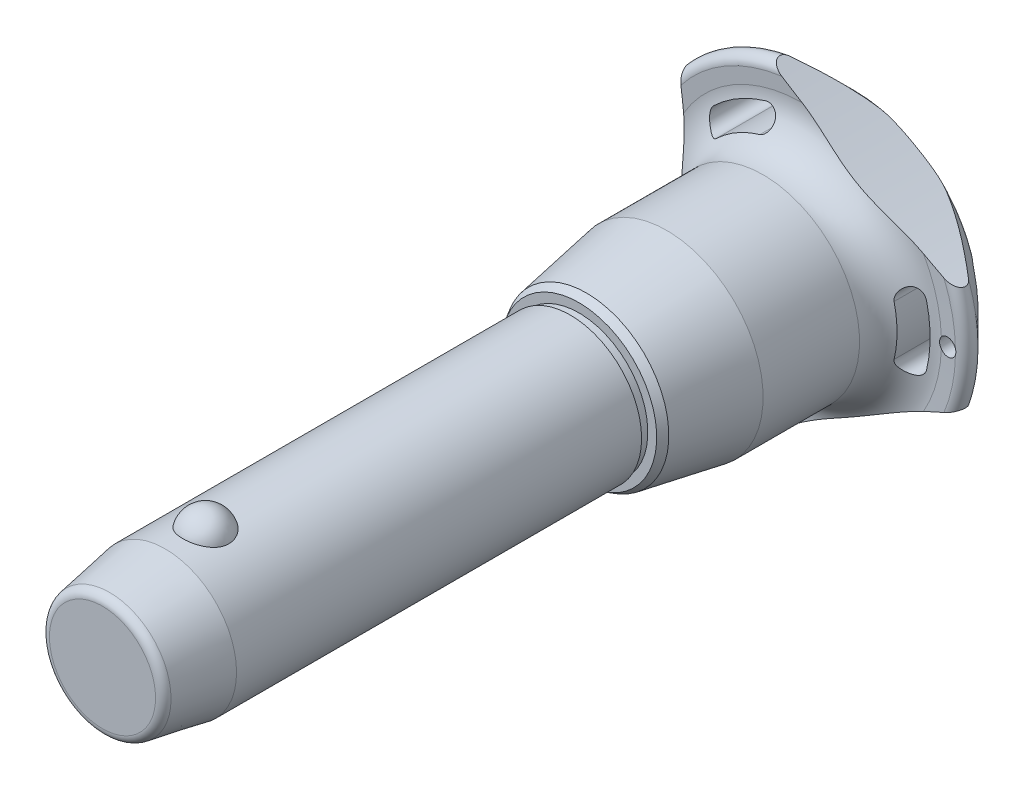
from build123d import *

# Parameters (mm, degrees)
SKETCH1_R           = 12.5
BOSS_EXTRUDE1_DEPTH = 60
SKETCH2_R           = 10
BOSS_EXTRUDE2_DEPTH = 50.7
BOSS_EXTRUDE3_START = 22
SKETCH1_2_R         = 12.5
BOSS_EXTRUDE3_DEPTH = 22
CHAMFER1_SIZE       = 11
CHAMFER1_SIZE2      = 1.939596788
FILLET1_R           = 1.5
SKETCH6_R           = 176.92625
CUT_EXTRUDE1_DEPTH  = 118.833791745
CIRPATTERN1_COUNT   = 3
SKETCH7_R           = 1.5
CUT_EXTRUDE2_DEPTH  = 118.704532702


with BuildPart() as part:
    # Sketch1 → Boss-Extrude1 (new body)
    with BuildSketch(Plane.XY):
        Circle(SKETCH1_R)
    extrude(amount=-BOSS_EXTRUDE1_DEPTH)

    # Sketch2 → Boss-Extrude2 (add)
    with BuildSketch(Plane(origin=(0, 0, -60), x_dir=(-1, 0, 0), z_dir=(0, 0, -1))):
        with Locations(Location((0, 0, 0), (0, 0, 180))):
            Circle(SKETCH2_R)
    extrude(amount=BOSS_EXTRUDE2_DEPTH)

    # Sketch3 → Revolve1 (revolve)
    with BuildSketch(Plane(origin=(0, 0, 0), x_dir=(0, 0, -1), z_dir=(1, 0, 0))):
        with BuildLine():
            Line((-3.957271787, 15.4), (-3.957271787, 7.1))
            ThreePointArc((-3.957271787, 7.1), (0.192728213, 11.25), (-3.957271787, 15.4))
        make_face()
        with BuildLine():
            Line((-3.957271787, -7.1), (-3.957271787, -15.4))
            ThreePointArc((-3.957271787, -15.4), (0.192728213, -11.25), (-3.957271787, -7.1))
        make_face()
    revolve(axis=Axis((0, -7.1, 3.957271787), (0, 1, 0)))

    # Sketch1_2 → Boss-Extrude3 (add)
    with BuildSketch(Plane.XY.offset(BOSS_EXTRUDE3_START)):
        Circle(SKETCH1_2_R)
    extrude(amount=-BOSS_EXTRUDE3_DEPTH)

    # Chamfer1
    chamfer1_edges = [part.edges().sort_by_distance(p)[0] for p in [
        (-12.5, 0, 22),
    ]]
    chamfer1_side = [part.faces().sort_by_distance(p)[0] for p in [
        (-12.5, 0, -19),
    ]]
    chamfer(chamfer1_edges, length=CHAMFER1_SIZE, length2=CHAMFER1_SIZE2, reference=chamfer1_side[0])

    # Fillet1
    fillet1_edges = [part.edges().sort_by_distance(p)[0] for p in [
        (-10.560403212, 0, 22),
        (-10, 0, -110.7),
    ]]
    fillet(fillet1_edges, radius=FILLET1_R)

    # Sketch4 → Revolve2 (revolve)
    with BuildSketch(Plane(origin=(0, 0, 0), x_dir=(0, 0, -1), z_dir=(1, 0, 0)), mode=Mode.PRIVATE) as revolve2_sk:
        Polygon((60, 0), (60, 12.089202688), (61.5, 12.089202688), (61.5, 13.644437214), (62.846872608, 14.422054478), (76.9, 16.9), (93.8, 16.9), (93.8, 0), align=None)
    revolve(revolve2_sk.sketch.rotate(Axis((0, 0, -93.8), (0, 0, 1)), 90), axis=Axis((0, 0, -93.8), (0, 0, 1)))

    # Sketch5 → Revolve3 (revolve)
    with BuildSketch(Plane(origin=(0, 0, 0), x_dir=(0, 0, -1), z_dir=(1, 0, 0)), mode=Mode.PRIVATE) as revolve3_sk:
        with BuildLine():
            Line((100.790129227, 24.271609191), (100.652256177, 26.865060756))
            ThreePointArc((100.652256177, 26.865060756), (101.598671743, 28.411427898), (103.38137085, 28.08137085))
            Line((103.38137085, 28.08137085), (109.763226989, 21.69951471))
            ThreePointArc((109.763226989, 21.69951471), (110.7, 19.381044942), (109.683055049, 17.096604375))
            ThreePointArc((109.683055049, 17.096604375), (104.18864484, 9.321268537), (102.25, 0))
            Line((102.25, 0), (93.8, 0))
            Line((93.8, 0), (93.8, 16.9))
            ThreePointArc((93.8, 16.9), (98.879432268, 19.083427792), (100.790129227, 24.271609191))
        make_face()
    revolve(revolve3_sk.sketch.rotate(Axis((0, 0, -102.25), (0, 0, 1)), 90), axis=Axis((0, 0, -102.25), (0, 0, 1)))

    # Sketch6 → Cut-Extrude1 (cut, through all)
    with BuildSketch(Plane.XY):
        with Locations((-197.42625, 0)):
            Circle(SKETCH6_R)
        with BuildLine():
            ThreePointArc((21.802992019, -5.260839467), (22.428706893, 0), (21.802992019, 5.260839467))
            ThreePointArc((21.802992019, 5.260839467), (19.579234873, 6.620060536), (18.220013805, 4.39630339))
            ThreePointArc((18.220013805, 4.39630339), (18.742902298, 0), (18.220013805, -4.39630339))
            ThreePointArc((18.220013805, -4.39630339), (19.579234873, -6.620060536), (21.802992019, -5.260839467))
        make_face()
    cut_extrude1 = extrude(amount=-CUT_EXTRUDE1_DEPTH, mode=Mode.SUBTRACT)

    # CirPattern1: Cut-Extrude1 ×3 about axis
    cirpattern1_axis = Axis((0, 0, 0), (0, 0, 1))
    for i in range(1, CIRPATTERN1_COUNT):
        add(cut_extrude1.rotate(cirpattern1_axis, i * 360 / CIRPATTERN1_COUNT), mode=Mode.SUBTRACT)

    # Sketch7 → Cut-Extrude2 (cut, through all)
    with BuildSketch(Plane.XY):
        with Locations(Location((25.428706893, 0, 0), (0, 0, 17.230769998))):
            Circle(SKETCH7_R)
    extrude(amount=-CUT_EXTRUDE2_DEPTH, mode=Mode.SUBTRACT)


solid = part.part
